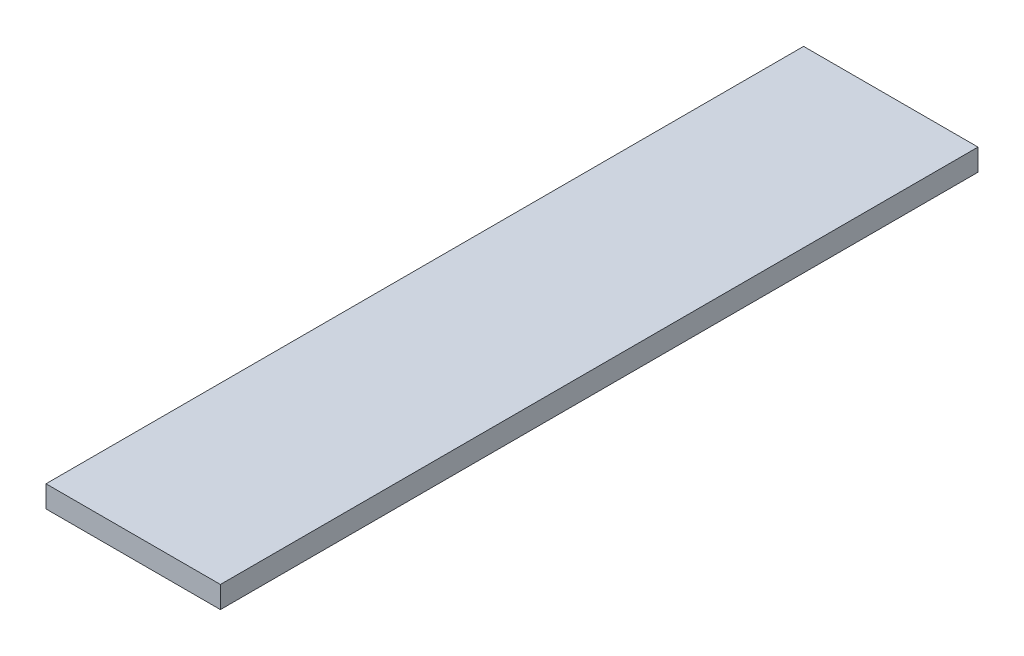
ISO-10303-21;
HEADER;
FILE_DESCRIPTION(('STEP AP214'),'2;1');
FILE_NAME('part.step','',(''),(''),'','','');
FILE_SCHEMA(('AUTOMOTIVE_DESIGN { 1 0 10303 214 1 1 1 1 }'));
ENDSEC;
DATA;
#1=APPLICATION_CONTEXT('core data for automotive mechanical design processes');
#2=APPLICATION_PROTOCOL_DEFINITION('international standard','automotive_design',2000,#1);
#3=PRODUCT_CONTEXT('',#1,'mechanical');
#4=PRODUCT('Part','Part','',(#3));
#5=PRODUCT_RELATED_PRODUCT_CATEGORY('part','',(#4));
#6=PRODUCT_DEFINITION_FORMATION('','',#4);
#7=PRODUCT_DEFINITION_CONTEXT('part definition',#1,'design');
#8=PRODUCT_DEFINITION('design','',#6,#7);
#9=PRODUCT_DEFINITION_SHAPE('','',#8);
#10=(LENGTH_UNIT() NAMED_UNIT(*) SI_UNIT(.MILLI.,.METRE.));
#11=(NAMED_UNIT(*) PLANE_ANGLE_UNIT() SI_UNIT($,.RADIAN.));
#12=(NAMED_UNIT(*) SI_UNIT($,.STERADIAN.) SOLID_ANGLE_UNIT());
#13=UNCERTAINTY_MEASURE_WITH_UNIT(LENGTH_MEASURE(1.E-05),#10,'distance_accuracy_value','');
#14=(GEOMETRIC_REPRESENTATION_CONTEXT(3) GLOBAL_UNCERTAINTY_ASSIGNED_CONTEXT((#13)) GLOBAL_UNIT_ASSIGNED_CONTEXT((#10,
#11,#12)) REPRESENTATION_CONTEXT('',''));
#15=CARTESIAN_POINT('',(0.,0.,0.));
#16=DIRECTION('',(0.,0.,1.));
#17=DIRECTION('',(1.,0.,0.));
#18=AXIS2_PLACEMENT_3D('',#15,#16,#17);
#19=CARTESIAN_POINT('',(25.4,6.35,-110.33125));
#20=DIRECTION('',(-1.,0.,0.));
#21=DIRECTION('',(0.,0.,1.));
#22=AXIS2_PLACEMENT_3D('',#19,#20,#21);
#23=PLANE('',#22);
#24=DIRECTION('',(0.,0.,-1.));
#25=VECTOR('',#24,1.);
#26=CARTESIAN_POINT('',(25.4,0.,-110.33125));
#27=LINE('',#26,#25);
#28=CARTESIAN_POINT('',(25.4,0.,110.33125));
#29=VERTEX_POINT('',#28);
#30=CARTESIAN_POINT('',(25.4,0.,-110.33125));
#31=VERTEX_POINT('',#30);
#32=EDGE_CURVE('E97',#29,#31,#27,.T.);
#33=ORIENTED_EDGE('',*,*,#32,.T.);
#34=DIRECTION('',(0.,-1.,0.));
#35=VECTOR('',#34,1.);
#36=CARTESIAN_POINT('',(25.4,6.35,-110.33125));
#37=LINE('',#36,#35);
#38=CARTESIAN_POINT('',(25.4,6.35,-110.33125));
#39=VERTEX_POINT('',#38);
#40=EDGE_CURVE('E11',#39,#31,#37,.T.);
#41=ORIENTED_EDGE('',*,*,#40,.F.);
#42=DIRECTION('',(0.,0.,-1.));
#43=VECTOR('',#42,1.);
#44=CARTESIAN_POINT('',(25.4,6.35,-110.33125));
#45=LINE('',#44,#43);
#46=CARTESIAN_POINT('',(25.4,6.35,110.33125));
#47=VERTEX_POINT('',#46);
#48=EDGE_CURVE('E85',#47,#39,#45,.T.);
#49=ORIENTED_EDGE('',*,*,#48,.F.);
#50=DIRECTION('',(0.,-1.,0.));
#51=VECTOR('',#50,1.);
#52=CARTESIAN_POINT('',(25.4,6.35,110.33125));
#53=LINE('',#52,#51);
#54=EDGE_CURVE('E93',#47,#29,#53,.T.);
#55=ORIENTED_EDGE('',*,*,#54,.T.);
#56=EDGE_LOOP('',(#33,#41,#49,#55));
#57=FACE_BOUND('',#56,.T.);
#58=ADVANCED_FACE('F34',(#57),#23,.F.);
#59=CARTESIAN_POINT('',(-25.4,6.35,-110.33125));
#60=DIRECTION('',(0.,0.,1.));
#61=DIRECTION('',(1.,0.,0.));
#62=AXIS2_PLACEMENT_3D('',#59,#60,#61);
#63=PLANE('',#62);
#64=DIRECTION('',(-1.,0.,0.));
#65=VECTOR('',#64,1.);
#66=CARTESIAN_POINT('',(-25.4,0.,-110.33125));
#67=LINE('',#66,#65);
#68=CARTESIAN_POINT('',(-25.4,0.,-110.33125));
#69=VERTEX_POINT('',#68);
#70=EDGE_CURVE('E89',#31,#69,#67,.T.);
#71=ORIENTED_EDGE('',*,*,#70,.T.);
#72=DIRECTION('',(0.,-1.,0.));
#73=VECTOR('',#72,1.);
#74=CARTESIAN_POINT('',(-25.4,6.35,-110.33125));
#75=LINE('',#74,#73);
#76=CARTESIAN_POINT('',(-25.4,6.35,-110.33125));
#77=VERTEX_POINT('',#76);
#78=EDGE_CURVE('E42',#77,#69,#75,.T.);
#79=ORIENTED_EDGE('',*,*,#78,.F.);
#80=DIRECTION('',(-1.,0.,0.));
#81=VECTOR('',#80,1.);
#82=CARTESIAN_POINT('',(-25.4,6.35,-110.33125));
#83=LINE('',#82,#81);
#84=EDGE_CURVE('E80',#39,#77,#83,.T.);
#85=ORIENTED_EDGE('',*,*,#84,.F.);
#86=ORIENTED_EDGE('',*,*,#40,.T.);
#87=EDGE_LOOP('',(#71,#79,#85,#86));
#88=FACE_BOUND('',#87,.T.);
#89=ADVANCED_FACE('F88',(#88),#63,.F.);
#90=CARTESIAN_POINT('',(-25.4,6.35,-110.33125));
#91=DIRECTION('',(1.,0.,0.));
#92=DIRECTION('',(0.,0.,-1.));
#93=AXIS2_PLACEMENT_3D('',#90,#91,#92);
#94=PLANE('',#93);
#95=DIRECTION('',(0.,0.,1.));
#96=VECTOR('',#95,1.);
#97=CARTESIAN_POINT('',(-25.4,0.,-110.33125));
#98=LINE('',#97,#96);
#99=CARTESIAN_POINT('',(-25.4,0.,110.33125));
#100=VERTEX_POINT('',#99);
#101=EDGE_CURVE('E67',#69,#100,#98,.T.);
#102=ORIENTED_EDGE('',*,*,#101,.T.);
#103=DIRECTION('',(0.,-1.,0.));
#104=VECTOR('',#103,1.);
#105=CARTESIAN_POINT('',(-25.4,6.35,110.33125));
#106=LINE('',#105,#104);
#107=CARTESIAN_POINT('',(-25.4,6.35,110.33125));
#108=VERTEX_POINT('',#107);
#109=EDGE_CURVE('E90',#108,#100,#106,.T.);
#110=ORIENTED_EDGE('',*,*,#109,.F.);
#111=DIRECTION('',(0.,0.,1.));
#112=VECTOR('',#111,1.);
#113=CARTESIAN_POINT('',(-25.4,6.35,-110.33125));
#114=LINE('',#113,#112);
#115=EDGE_CURVE('E83',#77,#108,#114,.T.);
#116=ORIENTED_EDGE('',*,*,#115,.F.);
#117=ORIENTED_EDGE('',*,*,#78,.T.);
#118=EDGE_LOOP('',(#102,#110,#116,#117));
#119=FACE_BOUND('',#118,.T.);
#120=ADVANCED_FACE('F91',(#119),#94,.F.);
#121=CARTESIAN_POINT('',(-25.4,6.35,110.33125));
#122=DIRECTION('',(0.,0.,-1.));
#123=DIRECTION('',(-1.,0.,0.));
#124=AXIS2_PLACEMENT_3D('',#121,#122,#123);
#125=PLANE('',#124);
#126=DIRECTION('',(1.,0.,0.));
#127=VECTOR('',#126,1.);
#128=CARTESIAN_POINT('',(-25.4,0.,110.33125));
#129=LINE('',#128,#127);
#130=EDGE_CURVE('E73',#100,#29,#129,.T.);
#131=ORIENTED_EDGE('',*,*,#130,.T.);
#132=ORIENTED_EDGE('',*,*,#54,.F.);
#133=DIRECTION('',(1.,0.,0.));
#134=VECTOR('',#133,1.);
#135=CARTESIAN_POINT('',(-25.4,6.35,110.33125));
#136=LINE('',#135,#134);
#137=EDGE_CURVE('E50',#108,#47,#136,.T.);
#138=ORIENTED_EDGE('',*,*,#137,.F.);
#139=ORIENTED_EDGE('',*,*,#109,.T.);
#140=EDGE_LOOP('',(#131,#132,#138,#139));
#141=FACE_BOUND('',#140,.T.);
#142=ADVANCED_FACE('F104',(#141),#125,.F.);
#143=CARTESIAN_POINT('',(0.,6.35,0.));
#144=DIRECTION('',(0.,1.,0.));
#145=DIRECTION('',(0.,0.,1.));
#146=AXIS2_PLACEMENT_3D('',#143,#144,#145);
#147=PLANE('',#146);
#148=ORIENTED_EDGE('',*,*,#48,.T.);
#149=ORIENTED_EDGE('',*,*,#84,.T.);
#150=ORIENTED_EDGE('',*,*,#115,.T.);
#151=ORIENTED_EDGE('',*,*,#137,.T.);
#152=EDGE_LOOP('',(#148,#149,#150,#151));
#153=FACE_BOUND('',#152,.T.);
#154=ADVANCED_FACE('F81',(#153),#147,.T.);
#155=CARTESIAN_POINT('',(0.,0.,0.));
#156=DIRECTION('',(0.,1.,0.));
#157=DIRECTION('',(0.,0.,1.));
#158=AXIS2_PLACEMENT_3D('',#155,#156,#157);
#159=PLANE('',#158);
#160=ORIENTED_EDGE('',*,*,#32,.F.);
#161=ORIENTED_EDGE('',*,*,#130,.F.);
#162=ORIENTED_EDGE('',*,*,#101,.F.);
#163=ORIENTED_EDGE('',*,*,#70,.F.);
#164=EDGE_LOOP('',(#160,#161,#162,#163));
#165=FACE_BOUND('',#164,.T.);
#166=ADVANCED_FACE('F107',(#165),#159,.F.);
#167=CLOSED_SHELL('',(#58,#89,#120,#142,#154,#166));
#168=MANIFOLD_SOLID_BREP('B2',#167);
#169=ADVANCED_BREP_SHAPE_REPRESENTATION('',(#18,#168),#14);
#170=SHAPE_DEFINITION_REPRESENTATION(#9,#169);
ENDSEC;
END-ISO-10303-21;
